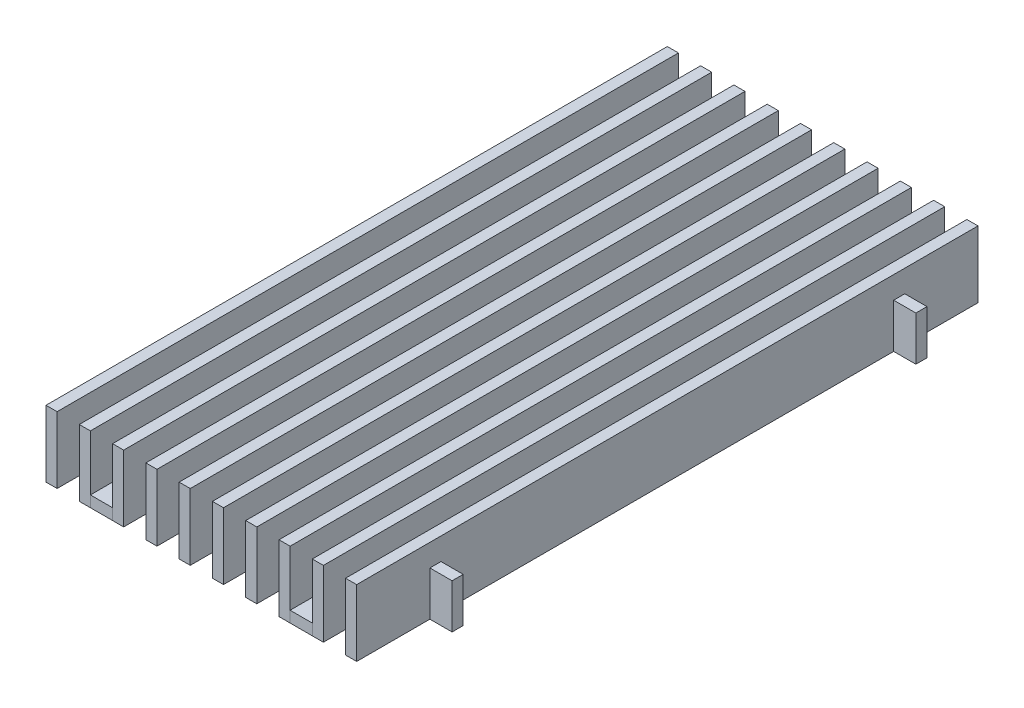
from build123d import *

# Parameters (mm, degrees)
SKETCH1_W             = 3.175
SKETCH1_H             = 19.05
BOSS_EXTRUDE1_DEPTH   = 177.8
LPATTERN1_COUNT       = 10
LPATTERN1_PITCH       = 9.525
SKETCH2_W             = 3.175
SKETCH2_H             = 12.7
BOSS_EXTRUDE2_DEPTH   = 50.8
SKETCH3_W             = 6.35
SKETCH3_H             = 12.7
SKETCH3_R             = 1.5875
BOSS_EXTRUDE3_DEPTH   = 3.175
BOSS_EXTRUDE3_2_DEPTH = 3.175
BOSS_EXTRUDE3_3_DEPTH = 3.175
BOSS_EXTRUDE3_4_DEPTH = 3.175


with BuildPart() as part:
    # Sketch1 → Boss-Extrude1 (new body)
    with BuildSketch(Plane.XY):
        Rectangle(SKETCH1_W, SKETCH1_H)
    extrude(amount=-BOSS_EXTRUDE1_DEPTH)


with BuildPart() as lpattern1_1:
    # LPattern1: pattern copy
    add(part.part.moved(Location(Vector(1, 0, 0) * (1 * LPATTERN1_PITCH))))


with BuildPart() as lpattern1_2:
    # LPattern1: pattern copy
    add(part.part.moved(Location(Vector(1, 0, 0) * (2 * LPATTERN1_PITCH))))


with BuildPart() as lpattern1_3:
    # LPattern1: pattern copy
    add(part.part.moved(Location(Vector(1, 0, 0) * (3 * LPATTERN1_PITCH))))


with BuildPart() as lpattern1_4:
    # LPattern1: pattern copy
    add(part.part.moved(Location(Vector(1, 0, 0) * (4 * LPATTERN1_PITCH))))


with BuildPart() as lpattern1_5:
    # LPattern1: pattern copy
    add(part.part.moved(Location(Vector(1, 0, 0) * (5 * LPATTERN1_PITCH))))


with BuildPart() as lpattern1_6:
    # LPattern1: pattern copy
    add(part.part.moved(Location(Vector(1, 0, 0) * (6 * LPATTERN1_PITCH))))


with BuildPart() as lpattern1_7:
    # LPattern1: pattern copy
    add(part.part.moved(Location(Vector(1, 0, 0) * (7 * LPATTERN1_PITCH))))


with BuildPart() as lpattern1_8:
    # LPattern1: pattern copy
    add(part.part.moved(Location(Vector(1, 0, 0) * (8 * LPATTERN1_PITCH))))


with BuildPart() as lpattern1_9:
    # LPattern1: pattern copy
    add(part.part.moved(Location(Vector(1, 0, 0) * (9 * LPATTERN1_PITCH))))


with BuildPart() as part_1:
    add(part.part)

    add(lpattern1_1.part)  # Boss-Extrude2 merges LPattern1_1

    add(lpattern1_2.part)  # Boss-Extrude2 merges LPattern1_2

    add(lpattern1_3.part)  # Boss-Extrude2 merges LPattern1_3

    add(lpattern1_4.part)  # Boss-Extrude2 merges LPattern1_4

    add(lpattern1_5.part)  # Boss-Extrude2 merges LPattern1_5

    add(lpattern1_6.part)  # Boss-Extrude2 merges LPattern1_6

    add(lpattern1_7.part)  # Boss-Extrude2 merges LPattern1_7

    add(lpattern1_8.part)  # Boss-Extrude2 merges LPattern1_8

    add(lpattern1_9.part)  # Boss-Extrude2 merges LPattern1_9
    # Sketch2 → Boss-Extrude2 (add, symmetric)
    with BuildSketch(Plane.ZY.offset(-42.8625)):
        with Locations((-155.2575, -3.175)):
            Rectangle(SKETCH2_W, SKETCH2_H)
        with Locations((-22.5425, -3.175)):
            Rectangle(SKETCH2_W, SKETCH2_H)
    extrude(amount=BOSS_EXTRUDE2_DEPTH, both=True)


with BuildPart() as body_2:
    # Sketch3 → Boss-Extrude3 (new body)
    with BuildSketch(Plane.XZ.offset(9.525)):
        with Locations((14.2875, -171.45)):
            Rectangle(SKETCH3_W, SKETCH3_H)
        with Locations(Location((14.2875, -171.45, 0), (0, 0, 270))):
            Circle(SKETCH3_R, mode=Mode.SUBTRACT)
    extrude(amount=-BOSS_EXTRUDE3_DEPTH)


with BuildPart() as body_3:
    # Sketch3 → Boss-Extrude3 2 (new body)
    with BuildSketch(Plane.XZ.offset(9.525)):
        with Locations((71.4375, -171.45)):
            Rectangle(SKETCH3_W, SKETCH3_H)
        with Locations(Location((71.4375, -171.45, 0), (0, 0, 90))):
            Circle(SKETCH3_R, mode=Mode.SUBTRACT)
    extrude(amount=-BOSS_EXTRUDE3_2_DEPTH)


with BuildPart() as body_4:
    # Sketch3 → Boss-Extrude3 3 (new body)
    with BuildSketch(Plane.XZ.offset(9.525)):
        with Locations((71.4375, -6.35)):
            Rectangle(SKETCH3_W, SKETCH3_H)
        with Locations(Location((71.4375, -6.35, 0), (0, 0, 270))):
            Circle(SKETCH3_R, mode=Mode.SUBTRACT)
    extrude(amount=-BOSS_EXTRUDE3_3_DEPTH)


with BuildPart() as body_5:
    # Sketch3 → Boss-Extrude3 4 (new body)
    with BuildSketch(Plane.XZ.offset(9.525)):
        with Locations((14.2875, -6.35)):
            Rectangle(SKETCH3_W, SKETCH3_H)
        with Locations(Location((14.2875, -6.35, 0), (0, 0, 90))):
            Circle(SKETCH3_R, mode=Mode.SUBTRACT)
    extrude(amount=-BOSS_EXTRUDE3_4_DEPTH)


solid = Compound([part_1.part, body_2.part, body_3.part, body_4.part, body_5.part])
